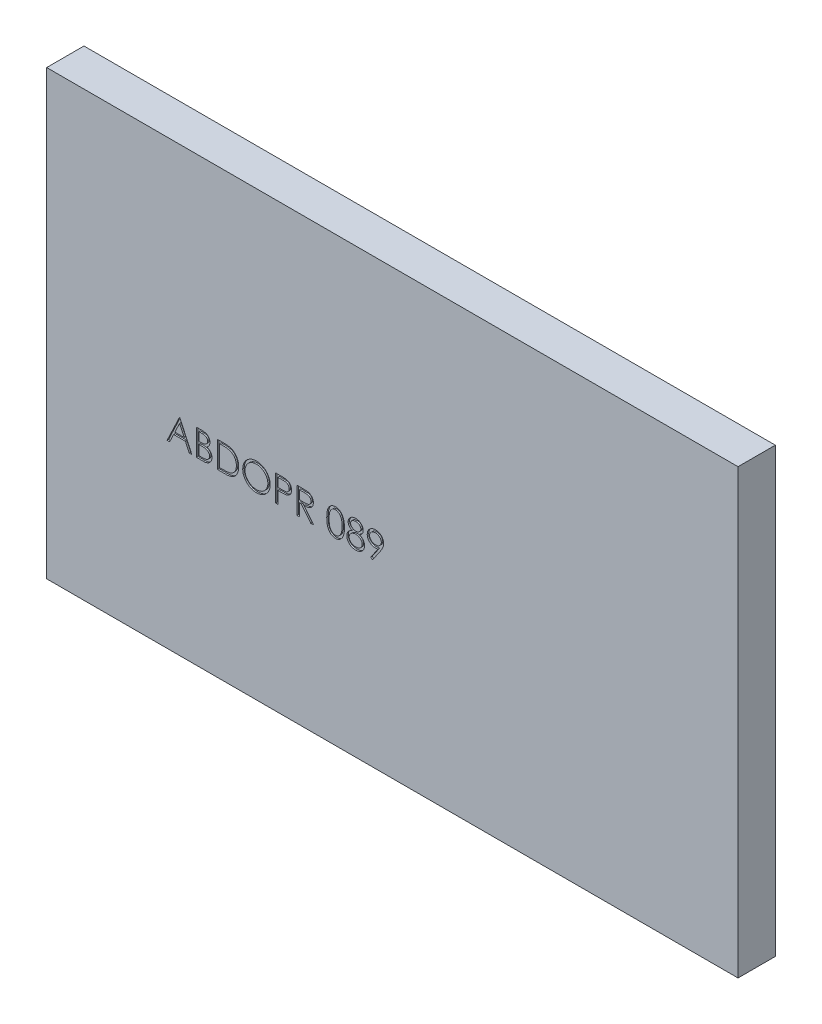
from build123d import *

# Parameters (mm, degrees)
SKIZZE1_W                       = 92.693693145
SKIZZE1_H                       = 59.371325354
LINEAR_AUSTRAGEN1_DEPTH         = 5
SCHNITT_LINEAR_AUSTRAGEN1_DEPTH = 0.2


with BuildPart() as part:
    # Skizze1 → Linear austragen1 (new body)
    with BuildSketch(Plane.XY):
        with Locations((46.346846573, 29.685662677)):
            Rectangle(SKIZZE1_W, SKIZZE1_H)
    extrude(amount=-LINEAR_AUSTRAGEN1_DEPTH)

    # Skizze2 → Schnitt-Linear austragen1 (cut)
    # profile 1 of 9: a face of its own
    with BuildSketch(Plane.XY):
        Polygon((17.849815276, 27.652351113), (19.465199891, 24.152351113), (19.123753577, 24.152351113), (18.606325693, 25.274145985), (17.019687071, 25.274145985), (16.487535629, 24.152351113), (16.144687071, 24.152351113), (17.804943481, 27.652351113), align=None)
        Polygon((17.82387377, 26.970159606), (17.190059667, 25.633120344), (18.440860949, 25.633120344), align=None, mode=Mode.SUBTRACT)
    # profile 2 of 9: a face of its own
    with BuildSketch(Plane.XY):
        with BuildLine():
            Line((20.09340502, 27.652351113), (20.776297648, 27.652351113))
            add(Edge.make_bspline(
                [(20.776297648, 27.652351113), (20.809726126, 27.652175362), (20.874518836, 27.651834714), (20.968738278, 27.646551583), (21.056987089, 27.639347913), (21.139290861, 27.627917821), (21.215611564, 27.614126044), (21.286179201, 27.597424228), (21.350769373, 27.577397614), (21.427882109, 27.545551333), (21.51580277, 27.498228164), (21.611001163, 27.428299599), (21.692405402, 27.342767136), (21.76259172, 27.246284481), (21.818392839, 27.140148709), (21.858762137, 27.02688952), (21.884320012, 26.907967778), (21.886948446, 26.8263246), (21.888276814, 26.785063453)],
                knots=[0, 0, 0, 0, 1.001505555, 1.941167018, 2.826882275, 3.653841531, 4.429895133, 5.150066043, 5.825578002, 6.45369114, 7.647487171, 8.808567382, 9.977351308, 11.170798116, 12.373658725, 13.556498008, 14.765093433, 16, 16, 16, 16], degree=3))
            add(Edge.make_bspline(
                [(21.888276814, 26.785063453), (21.887183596, 26.746410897), (21.885035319, 26.67045498), (21.864492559, 26.559360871), (21.832331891, 26.453609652), (21.787626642, 26.353587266), (21.729524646, 26.261553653), (21.660666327, 26.176766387), (21.577589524, 26.10281533), (21.515346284, 26.061472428), (21.483729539, 26.040472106)],
                knots=[0, 0, 0, 0, 1.044552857, 2.05264487, 3.044412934, 4.028983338, 5.005914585, 5.980388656, 6.974128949, 8, 8, 8, 8], degree=3))
            add(Edge.make_bspline(
                [(21.483729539, 26.040472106), (21.523489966, 26.025207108), (21.599561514, 25.996001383), (21.704247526, 25.944365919), (21.794442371, 25.888203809), (21.870839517, 25.826871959), (21.936177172, 25.760763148), (21.993230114, 25.688908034), (22.041911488, 25.610369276), (22.083624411, 25.52596574), (22.116173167, 25.436559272), (22.140549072, 25.342988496), (22.154516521, 25.245588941), (22.156504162, 25.179303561), (22.157507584, 25.145840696)],
                knots=[0, 0, 0, 0, 1.27268992, 2.434971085, 3.483601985, 4.442670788, 5.356604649, 6.2567628, 7.179492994, 8.113709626, 9.066344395, 10.018646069, 10.999752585, 12, 12, 12, 12], degree=3))
            add(Edge.make_bspline(
                [(22.157507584, 25.145840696), (22.156530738, 25.111673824), (22.154608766, 25.044449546), (22.140428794, 24.945694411), (22.116419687, 24.851319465), (22.083348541, 24.760714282), (22.040186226, 24.674054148), (21.987658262, 24.591240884), (21.925026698, 24.513106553), (21.854963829, 24.43878293), (21.775701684, 24.371955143), (21.690185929, 24.312439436), (21.597339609, 24.263493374), (21.498687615, 24.222377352), (21.393123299, 24.190970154), (21.281120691, 24.16899758), (21.162776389, 24.154192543), (21.081566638, 24.152975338), (21.039919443, 24.152351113)],
                knots=[0, 0, 0, 0, 0.978564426, 1.925352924, 2.850884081, 3.763762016, 4.682927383, 5.618979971, 6.567305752, 7.547517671, 8.540179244, 9.531824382, 10.526200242, 11.540722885, 12.589160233, 13.674978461, 14.80764778, 16, 16, 16, 16], degree=3))
            Line((21.039919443, 24.152351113), (20.09340502, 24.152351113))
            Line((20.09340502, 24.152351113), (20.09340502, 27.652351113))
        make_face()
        with BuildLine():
            Line((20.407507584, 27.293376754), (20.407507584, 26.171581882))
            Line((20.407507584, 26.171581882), (20.618545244, 26.171581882))
            add(Edge.make_bspline(
                [(20.618545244, 26.171581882), (20.649394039, 26.171981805), (20.709000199, 26.172754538), (20.795320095, 26.174968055), (20.875445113, 26.181166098), (20.949236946, 26.18736236), (21.01657939, 26.197436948), (21.077323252, 26.209429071), (21.132421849, 26.222111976), (21.195961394, 26.243681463), (21.268034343, 26.275559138), (21.344867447, 26.325030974), (21.412601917, 26.383955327), (21.469799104, 26.451946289), (21.516610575, 26.526812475), (21.54912429, 26.607359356), (21.571171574, 26.691579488), (21.573163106, 26.74939774), (21.57417425, 26.778753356)],
                knots=[0, 0, 0, 0, 1.156816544, 2.235205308, 3.236616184, 4.169592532, 5.011045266, 5.787822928, 6.49130361, 7.128639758, 8.301311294, 9.436451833, 10.541879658, 11.654887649, 12.756523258, 13.837046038, 14.901820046, 16, 16, 16, 16], degree=3))
            add(Edge.make_bspline(
                [(21.57417425, 26.778753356), (21.57364807, 26.798179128), (21.57261591, 26.8362849), (21.564162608, 26.891834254), (21.549795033, 26.944078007), (21.53134074, 26.993732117), (21.505552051, 27.039243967), (21.475188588, 27.082187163), (21.438502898, 27.121099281), (21.396745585, 27.15746878), (21.348736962, 27.189713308), (21.29450567, 27.217954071), (21.233317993, 27.240694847), (21.166205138, 27.260611), (21.092134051, 27.274599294), (21.011959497, 27.286252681), (20.925024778, 27.292185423), (20.864879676, 27.292970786), (20.833789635, 27.293376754)],
                knots=[0, 0, 0, 0, 0.91205012, 1.789085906, 2.630437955, 3.453916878, 4.269457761, 5.079663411, 5.91843418, 6.774407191, 7.675494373, 8.627863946, 9.638891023, 10.736472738, 11.911756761, 13.175263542, 14.539845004, 16, 16, 16, 16], degree=3))
            Line((20.833789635, 27.293376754), (20.407507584, 27.293376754))
        make_face(mode=Mode.SUBTRACT)
        with BuildLine():
            Line((20.407507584, 25.812607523), (20.407507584, 24.511325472))
            Line((20.407507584, 24.511325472), (20.854823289, 24.511325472))
            add(Edge.make_bspline(
                [(20.854823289, 24.511325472), (20.886842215, 24.511709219), (20.948554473, 24.512448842), (21.037655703, 24.514863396), (21.120238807, 24.520355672), (21.195926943, 24.529001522), (21.265537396, 24.538379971), (21.328235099, 24.550991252), (21.384528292, 24.565440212), (21.4498026, 24.587774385), (21.523306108, 24.622470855), (21.602516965, 24.674785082), (21.672943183, 24.73710839), (21.732748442, 24.809239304), (21.78176143, 24.887670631), (21.817416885, 24.970815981), (21.839407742, 25.057301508), (21.842069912, 25.116268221), (21.84340502, 25.145840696)],
                knots=[0, 0, 0, 0, 1.160039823, 2.235823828, 3.228722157, 4.157150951, 4.99529583, 5.772374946, 6.472645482, 7.099169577, 8.269452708, 9.405989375, 10.527446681, 11.663510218, 12.788923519, 13.866172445, 14.929861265, 16, 16, 16, 16], degree=3))
            add(Edge.make_bspline(
                [(21.84340502, 25.145840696), (21.843128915, 25.164334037), (21.84258116, 25.201022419), (21.834320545, 25.254938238), (21.822306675, 25.307164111), (21.806775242, 25.357841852), (21.784155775, 25.406055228), (21.757749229, 25.452757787), (21.726787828, 25.498011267), (21.678543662, 25.55522352), (21.608371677, 25.621140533), (21.508664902, 25.685678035), (21.395292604, 25.737725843), (21.313065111, 25.759825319), (21.270588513, 25.771241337)],
                knots=[0, 0, 0, 0, 0.723448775, 1.435228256, 2.130040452, 2.821711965, 3.505591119, 4.210454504, 4.921174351, 5.648778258, 7.137944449, 8.670945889, 10.280296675, 12, 12, 12, 12], degree=3))
            add(Edge.make_bspline(
                [(21.270588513, 25.771241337), (21.253559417, 25.774696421), (21.216636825, 25.782187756), (21.156429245, 25.790095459), (21.087693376, 25.797140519), (21.010270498, 25.802351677), (20.924062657, 25.80773822), (20.828885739, 25.809833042), (20.725128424, 25.812332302), (20.653136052, 25.812513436), (20.615740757, 25.812607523)],
                knots=[0, 0, 0, 0, 0.634451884, 1.375622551, 2.216452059, 3.157844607, 4.20941857, 5.370758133, 6.634282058, 8, 8, 8, 8], degree=3))
            Line((20.615740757, 25.812607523), (20.407507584, 25.812607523))
        make_face(mode=Mode.SUBTRACT)
    # profile 3 of 9: a face of its own
    with BuildSketch(Plane.XY):
        with BuildLine():
            Line((22.875456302, 24.152351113), (22.875456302, 27.652351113))
            Line((22.875456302, 27.652351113), (23.582187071, 27.652351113))
            add(Edge.make_bspline(
                [(23.582187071, 27.652351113), (23.643656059, 27.651908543), (23.762413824, 27.6510535), (23.934026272, 27.645632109), (24.092810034, 27.636041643), (24.238242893, 27.622072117), (24.370724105, 27.604919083), (24.489882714, 27.583418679), (24.596334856, 27.558030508), (24.661804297, 27.536385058), (24.692763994, 27.52614919)],
                knots=[0, 0, 0, 0, 1.314313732, 2.53924729, 3.670748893, 4.714932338, 5.66265055, 6.526160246, 7.303039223, 8, 8, 8, 8], degree=3))
            add(Edge.make_bspline(
                [(24.692763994, 27.52614919), (24.733258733, 27.510718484), (24.813329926, 27.48020699), (24.927337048, 27.422650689), (25.034662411, 27.357437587), (25.135881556, 27.284481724), (25.228682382, 27.201717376), (25.316690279, 27.11266029), (25.396305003, 27.01407195), (25.469213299, 26.907996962), (25.534948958, 26.79568491), (25.592088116, 26.677349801), (25.63954211, 26.553592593), (25.678935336, 26.424757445), (25.709981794, 26.290561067), (25.731163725, 26.150847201), (25.745134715, 26.006168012), (25.746538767, 25.907993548), (25.747251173, 25.85818044)],
                knots=[0, 0, 0, 0, 0.984719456, 1.947108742, 2.898477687, 3.838006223, 4.779231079, 5.722358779, 6.681677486, 7.655904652, 8.64651281, 9.637519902, 10.640069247, 11.656948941, 12.698408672, 13.768548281, 14.867775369, 16, 16, 16, 16], degree=3))
            add(Edge.make_bspline(
                [(25.747251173, 25.85818044), (25.746622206, 25.814919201), (25.74538276, 25.729668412), (25.734253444, 25.604027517), (25.718077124, 25.482113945), (25.693032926, 25.364508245), (25.662630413, 25.250180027), (25.623666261, 25.140347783), (25.579030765, 25.034003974), (25.526980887, 24.932586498), (25.469839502, 24.836503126), (25.408517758, 24.745927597), (25.343081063, 24.662152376), (25.27290543, 24.584923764), (25.198897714, 24.514358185), (25.120573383, 24.44986617), (25.037730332, 24.392709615), (24.95073961, 24.340642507), (24.85706348, 24.295222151), (24.754927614, 24.256792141), (24.643896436, 24.224945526), (24.524242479, 24.19837463), (24.395759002, 24.177297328), (24.258320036, 24.163170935), (24.112136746, 24.153618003), (24.011757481, 24.152781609), (23.960091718, 24.152351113)],
                knots=[0, 0, 0, 0, 1.105936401, 2.179363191, 3.223086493, 4.248585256, 5.251745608, 6.245858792, 7.225916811, 8.198733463, 9.158002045, 10.082870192, 10.993790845, 11.873723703, 12.748670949, 13.606408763, 14.465103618, 15.319838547, 16.196477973, 17.123216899, 18.106603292, 19.147568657, 20.255746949, 21.433717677, 22.679120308, 24, 24, 24, 24], degree=3))
            Line((23.960091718, 24.152351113), (22.875456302, 24.152351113))
        make_face()
        with BuildLine():
            Line((23.189558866, 24.511325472), (23.591301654, 24.511325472))
            add(Edge.make_bspline(
                [(23.591301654, 24.511325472), (23.649030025, 24.511573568), (23.760062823, 24.512050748), (23.919720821, 24.516237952), (24.065600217, 24.523079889), (24.197721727, 24.532654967), (24.316010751, 24.545323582), (24.420714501, 24.559448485), (24.511489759, 24.577045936), (24.566419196, 24.592996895), (24.591802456, 24.60036794)],
                knots=[0, 0, 0, 0, 1.375205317, 2.645023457, 3.804390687, 4.853969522, 5.800190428, 6.637939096, 7.370582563, 8, 8, 8, 8], degree=3))
            add(Edge.make_bspline(
                [(24.591802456, 24.60036794), (24.623750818, 24.611619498), (24.686884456, 24.633853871), (24.777765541, 24.674411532), (24.862522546, 24.722453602), (24.942632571, 24.775855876), (25.016959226, 24.836501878), (25.086383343, 24.903072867), (25.150765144, 24.975907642), (25.209439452, 25.054915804), (25.261947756, 25.139605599), (25.307418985, 25.229144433), (25.347270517, 25.322551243), (25.37854911, 25.421260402), (25.403064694, 25.52438946), (25.420429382, 25.631945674), (25.431244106, 25.743908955), (25.432505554, 25.82006108), (25.433148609, 25.858881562)],
                knots=[0, 0, 0, 0, 0.998632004, 1.973411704, 2.929992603, 3.868527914, 4.809262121, 5.754881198, 6.702106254, 7.672490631, 8.653608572, 9.636854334, 10.631411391, 11.644891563, 12.686317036, 13.754757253, 14.855430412, 16, 16, 16, 16], degree=3))
            add(Edge.make_bspline(
                [(25.433148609, 25.858881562), (25.432635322, 25.899815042), (25.431626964, 25.980229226), (25.418952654, 26.098219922), (25.400431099, 26.211700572), (25.373647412, 26.320678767), (25.339516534, 26.42536712), (25.296921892, 26.52518663), (25.248255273, 26.621191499), (25.190351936, 26.711165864), (25.126936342, 26.796258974), (25.056558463, 26.874213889), (24.980336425, 26.945208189), (24.899101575, 27.010347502), (24.810564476, 27.067011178), (24.716810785, 27.117697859), (24.616465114, 27.16071375), (24.546652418, 27.183592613), (24.511173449, 27.195219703)],
                knots=[0, 0, 0, 0, 1.122418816, 2.205001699, 3.251619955, 4.274784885, 5.280384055, 6.268708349, 7.249350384, 8.229342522, 9.199999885, 10.157847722, 11.105861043, 12.055065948, 13.010012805, 13.98527497, 14.976112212, 16, 16, 16, 16], degree=3))
            add(Edge.make_bspline(
                [(24.511173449, 27.195219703), (24.481822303, 27.203336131), (24.419413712, 27.220593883), (24.317574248, 27.239419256), (24.202959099, 27.256023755), (24.075059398, 27.270081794), (23.934020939, 27.280169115), (23.779735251, 27.28774043), (23.612135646, 27.292847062), (23.495953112, 27.29319577), (23.435652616, 27.293376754)],
                knots=[0, 0, 0, 0, 0.674548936, 1.434276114, 2.292660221, 3.240891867, 4.284742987, 5.42552168, 6.663806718, 8, 8, 8, 8], degree=3))
            Line((23.435652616, 27.293376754), (23.189558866, 27.293376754))
            Line((23.189558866, 27.293376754), (23.189558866, 24.511325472))
        make_face(mode=Mode.SUBTRACT)
    # profile 4 of 9: a face of its own
    with BuildSketch(Plane.XY):
        with BuildLine():
            add(Edge.make_bspline(
                [(28.103020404, 27.742094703), (28.16782851, 27.740453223), (28.295116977, 27.737229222), (28.482191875, 27.712550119), (28.66078697, 27.669854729), (28.832357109, 27.612991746), (28.994850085, 27.537137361), (29.149488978, 27.445452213), (29.295905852, 27.336975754), (29.432127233, 27.212546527), (29.556784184, 27.077163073), (29.66661007, 26.932685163), (29.758652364, 26.779986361), (29.834238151, 26.61952553), (29.89353676, 26.451665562), (29.934455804, 26.275511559), (29.960593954, 26.092204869), (29.963649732, 25.967178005), (29.965199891, 25.903753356)],
                knots=[0, 0, 0, 0, 1.065120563, 2.091984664, 3.0946048, 4.079830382, 5.057816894, 6.036188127, 7.030412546, 8.04752943, 9.064399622, 10.05169764, 11.02544977, 11.989514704, 12.962713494, 13.945757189, 14.957906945, 16, 16, 16, 16], degree=3))
            add(Edge.make_bspline(
                [(29.965199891, 25.903753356), (29.963649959, 25.84079591), (29.960594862, 25.71669949), (29.934426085, 25.534556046), (29.893385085, 25.359465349), (29.834788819, 25.191719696), (29.75956334, 25.031142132), (29.666908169, 24.878155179), (29.557766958, 24.73270868), (29.433560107, 24.596396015), (29.298159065, 24.471398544), (29.152928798, 24.362479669), (29.001135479, 24.268755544), (28.84082577, 24.19397187), (28.674125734, 24.13419995), (28.49954341, 24.09344732), (28.317896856, 24.067160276), (28.194025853, 24.06414176), (28.131065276, 24.062607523)],
                knots=[0, 0, 0, 0, 1.043624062, 2.057103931, 3.04512605, 4.022047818, 4.998200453, 5.980619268, 6.982898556, 8.009068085, 9.034988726, 10.034168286, 11.015286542, 11.987931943, 12.962482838, 13.94673481, 14.956375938, 16, 16, 16, 16], degree=3))
            add(Edge.make_bspline(
                [(28.131065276, 24.062607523), (28.067640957, 24.06415691), (27.942614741, 24.067211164), (27.759077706, 24.093392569), (27.582799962, 24.134333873), (27.414285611, 24.192843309), (27.253440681, 24.268460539), (27.099950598, 24.360664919), (26.954431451, 24.47007206), (26.818089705, 24.594238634), (26.693340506, 24.729410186), (26.584581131, 24.874244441), (26.492356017, 25.025899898), (26.416992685, 25.184797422), (26.357328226, 25.350168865), (26.316623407, 25.523117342), (26.290287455, 25.702656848), (26.287252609, 25.824899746), (26.285712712, 25.886926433)],
                knots=[0, 0, 0, 0, 1.053102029, 2.075944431, 3.073151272, 4.055350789, 5.033113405, 6.020478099, 7.024410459, 8.052272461, 9.079885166, 10.07527673, 11.055994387, 12.023226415, 12.992069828, 13.970394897, 14.97016774, 16, 16, 16, 16], degree=3))
            add(Edge.make_bspline(
                [(26.285712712, 25.886926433), (26.286247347, 25.928559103), (26.287309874, 26.011299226), (26.300101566, 26.134165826), (26.318663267, 26.255056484), (26.34526518, 26.373627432), (26.380056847, 26.489588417), (26.421108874, 26.603739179), (26.47124872, 26.714922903), (26.527929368, 26.823666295), (26.591191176, 26.928274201), (26.661066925, 27.027153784), (26.735102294, 27.121134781), (26.816265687, 27.207781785), (26.901882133, 27.289615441), (26.993340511, 27.365378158), (27.090082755, 27.435753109), (27.192525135, 27.49917345), (27.29814341, 27.556532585), (27.407020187, 27.605754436), (27.517676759, 27.648000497), (27.630631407, 27.682241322), (27.745584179, 27.709273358), (27.862785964, 27.727680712), (27.98214339, 27.74050503), (28.062554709, 27.741562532), (28.103020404, 27.742094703)],
                knots=[0, 0, 0, 0, 1.037015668, 2.060948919, 3.074880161, 4.083647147, 5.086022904, 6.090072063, 7.104153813, 8.122640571, 9.144368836, 10.147691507, 11.138137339, 12.123020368, 13.103399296, 14.087645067, 15.080126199, 16.082011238, 17.087798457, 18.072939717, 19.057185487, 20.037253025, 21.01195951, 21.997135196, 22.992090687, 24, 24, 24, 24], degree=3))
        make_face()
        with BuildLine():
            add(Edge.make_bspline(
                [(28.118445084, 27.383120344), (28.08523045, 27.382715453), (28.019118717, 27.381909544), (27.920834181, 27.371293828), (27.823842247, 27.356163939), (27.728122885, 27.334582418), (27.634076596, 27.305178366), (27.540826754, 27.271337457), (27.449223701, 27.230116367), (27.359569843, 27.183543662), (27.272654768, 27.131994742), (27.190642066, 27.075022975), (27.113319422, 27.01396442), (27.040876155, 26.948676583), (26.973524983, 26.878826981), (26.909940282, 26.805474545), (26.8526707, 26.726522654), (26.800185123, 26.644112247), (26.753217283, 26.558350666), (26.711451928, 26.470140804), (26.67728792, 26.378763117), (26.649425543, 26.285208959), (26.626325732, 26.1896265), (26.611691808, 26.091290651), (26.600959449, 25.990695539), (26.600199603, 25.922713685), (26.599815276, 25.888328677)],
                knots=[0, 0, 0, 0, 1.008559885, 2.007477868, 2.99961109, 3.989939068, 4.984837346, 5.991145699, 7.001802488, 8.033829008, 9.059044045, 10.069351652, 11.065060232, 12.050310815, 13.029377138, 14.011219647, 14.996725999, 15.989392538, 16.977580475, 17.965360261, 18.951710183, 19.937753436, 20.929683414, 21.935841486, 22.955955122, 24, 24, 24, 24], degree=3))
            add(Edge.make_bspline(
                [(26.599815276, 25.888328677), (26.601090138, 25.837766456), (26.603598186, 25.738294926), (26.625555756, 25.592526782), (26.65937773, 25.452438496), (26.709235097, 25.318796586), (26.771585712, 25.190452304), (26.848612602, 25.068544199), (26.939871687, 24.953039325), (27.043535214, 24.844744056), (27.156857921, 24.745898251), (27.27719065, 24.659134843), (27.403244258, 24.585724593), (27.535347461, 24.52591952), (27.672795, 24.478529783), (27.816472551, 24.446051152), (27.96542301, 24.424675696), (28.066953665, 24.42262294), (28.118445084, 24.421581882)],
                knots=[0, 0, 0, 0, 1.032063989, 2.030389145, 3.003944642, 3.970395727, 4.937377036, 5.913328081, 6.909231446, 7.93887556, 8.970685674, 9.976071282, 10.964166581, 11.944589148, 12.933237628, 13.927779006, 14.949070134, 16, 16, 16, 16], degree=3))
            add(Edge.make_bspline(
                [(28.118445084, 24.421581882), (28.153054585, 24.422057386), (28.221695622, 24.423000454), (28.323791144, 24.432499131), (28.424047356, 24.447731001), (28.522323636, 24.469661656), (28.618508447, 24.497108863), (28.71300325, 24.529716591), (28.80480154, 24.570397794), (28.895061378, 24.615345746), (28.98145762, 24.666585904), (29.063933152, 24.721624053), (29.140409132, 24.782592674), (29.212798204, 24.846910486), (29.280425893, 24.915874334), (29.342834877, 24.989394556), (29.399815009, 25.067935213), (29.452280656, 25.150220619), (29.499083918, 25.236216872), (29.539863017, 25.32474655), (29.574459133, 25.415591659), (29.602387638, 25.508883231), (29.6242731, 25.604444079), (29.63935302, 25.702402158), (29.649901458, 25.8025615), (29.650696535, 25.870305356), (29.651097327, 25.904454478)],
                knots=[0, 0, 0, 0, 1.047197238, 2.076906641, 3.100256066, 4.114471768, 5.12198147, 6.126382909, 7.136867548, 8.15857795, 9.17633901, 10.174870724, 11.156907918, 12.133735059, 13.104061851, 14.077631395, 15.04955518, 16.038496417, 17.029181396, 18.010275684, 18.986308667, 19.968651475, 20.955262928, 21.950658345, 22.966943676, 24, 24, 24, 24], degree=3))
            add(Edge.make_bspline(
                [(29.651097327, 25.904454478), (29.650696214, 25.938369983), (29.649900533, 26.005647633), (29.639358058, 26.105108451), (29.624257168, 26.202361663), (29.60249446, 26.297025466), (29.574444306, 26.389123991), (29.539856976, 26.478570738), (29.499071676, 26.565698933), (29.452263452, 26.65029323), (29.399647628, 26.731467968), (29.342153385, 26.809070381), (29.278788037, 26.881643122), (29.211362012, 26.950977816), (29.138191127, 27.015595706), (29.059606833, 27.075518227), (28.976563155, 27.132191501), (28.888635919, 27.183317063), (28.797891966, 27.230531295), (28.704778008, 27.270982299), (28.610348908, 27.305354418), (28.514844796, 27.334671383), (28.417461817, 27.356079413), (28.318857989, 27.371307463), (28.21916973, 27.381905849), (28.15212651, 27.382714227), (28.118445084, 27.383120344)],
                knots=[0, 0, 0, 0, 1.02996197, 2.043119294, 3.035359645, 4.018872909, 4.991431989, 5.957985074, 6.929999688, 7.912076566, 8.892894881, 9.867085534, 10.843653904, 11.817741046, 12.803660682, 13.806313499, 14.818574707, 15.856120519, 16.894564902, 17.924820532, 18.937903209, 19.946497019, 20.957711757, 21.963978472, 22.977135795, 24, 24, 24, 24], degree=3))
        make_face(mode=Mode.SUBTRACT)
    # profile 5 of 9: a face of its own
    with BuildSketch(Plane.XY):
        with BuildLine():
            Line((30.683148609, 27.652351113), (31.369546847, 27.652351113))
            add(Edge.make_bspline(
                [(31.369546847, 27.652351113), (31.416757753, 27.652299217), (31.507215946, 27.652199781), (31.636931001, 27.649185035), (31.754740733, 27.645158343), (31.860391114, 27.63957645), (31.954207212, 27.63297986), (32.035764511, 27.62372782), (32.105704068, 27.614067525), (32.147610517, 27.604246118), (32.166722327, 27.599766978)],
                knots=[0, 0, 0, 0, 1.415646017, 2.712440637, 3.8905458, 4.950247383, 5.884950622, 6.709939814, 7.411656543, 8, 8, 8, 8], degree=3))
            add(Edge.make_bspline(
                [(32.166722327, 27.599766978), (32.190915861, 27.593145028), (32.238732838, 27.580057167), (32.307633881, 27.553843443), (32.373187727, 27.522761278), (32.435619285, 27.487337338), (32.494161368, 27.446051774), (32.549687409, 27.400578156), (32.60170739, 27.349866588), (32.649928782, 27.294485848), (32.694213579, 27.235365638), (32.732343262, 27.171623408), (32.764270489, 27.104332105), (32.79165376, 27.033538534), (32.811362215, 26.95864821), (32.826209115, 26.880181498), (32.835632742, 26.798146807), (32.836535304, 26.74208694), (32.836994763, 26.71354903)],
                knots=[0, 0, 0, 0, 0.999701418, 1.975846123, 2.934577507, 3.890451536, 4.834027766, 5.787354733, 6.749476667, 7.726910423, 8.712836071, 9.690891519, 10.682875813, 11.679750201, 12.712814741, 13.765529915, 14.8625177, 16, 16, 16, 16], degree=3))
            add(Edge.make_bspline(
                [(32.836994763, 26.71354903), (32.836573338, 26.684771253), (32.835748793, 26.628465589), (32.825852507, 26.546092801), (32.812522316, 26.467374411), (32.792025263, 26.39248496), (32.76517959, 26.32186919), (32.733687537, 26.254447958), (32.695704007, 26.191368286), (32.652059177, 26.132401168), (32.603507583, 26.077491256), (32.550254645, 26.027036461), (32.492515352, 25.981332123), (32.430473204, 25.940275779), (32.363523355, 25.9048195), (32.292681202, 25.873062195), (32.217330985, 25.846391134), (32.165188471, 25.832361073), (32.138677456, 25.825227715)],
                knots=[0, 0, 0, 0, 1.121902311, 2.195077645, 3.232258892, 4.234102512, 5.217864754, 6.176164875, 7.132989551, 8.084763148, 9.034132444, 9.988522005, 10.94243251, 11.903244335, 12.886203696, 13.894208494, 14.929344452, 16, 16, 16, 16], degree=3))
            add(Edge.make_bspline(
                [(32.138677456, 25.825227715), (32.116750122, 25.820564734), (32.068695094, 25.81034554), (31.989552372, 25.798937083), (31.897406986, 25.789199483), (31.792384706, 25.781898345), (31.674579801, 25.775647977), (31.543928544, 25.770679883), (31.400174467, 25.767950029), (31.299903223, 25.767809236), (31.247551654, 25.767735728)],
                knots=[0, 0, 0, 0, 0.601384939, 1.31797006, 2.144135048, 3.087295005, 4.142315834, 5.309527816, 6.595305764, 8, 8, 8, 8], degree=3))
            Line((31.247551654, 25.767735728), (30.997251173, 25.767735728))
            Line((30.997251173, 25.767735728), (30.997251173, 24.152351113))
            Line((30.997251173, 24.152351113), (30.683148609, 24.152351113))
            Line((30.683148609, 24.152351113), (30.683148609, 27.652351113))
        make_face()
        with BuildLine():
            Line((30.997251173, 27.293376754), (30.997251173, 26.126710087))
            Line((30.997251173, 26.126710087), (31.610031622, 26.118997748))
            add(Edge.make_bspline(
                [(31.610031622, 26.118997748), (31.639951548, 26.118982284), (31.697711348, 26.118952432), (31.781147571, 26.122937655), (31.858556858, 26.127538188), (31.929701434, 26.134274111), (31.994613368, 26.143795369), (32.053400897, 26.153407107), (32.10560818, 26.167312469), (32.166707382, 26.186035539), (32.234790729, 26.217968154), (32.308858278, 26.264318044), (32.371628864, 26.323398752), (32.425947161, 26.389826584), (32.469053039, 26.463725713), (32.500609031, 26.54279465), (32.519150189, 26.626222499), (32.521636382, 26.683310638), (32.522892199, 26.712146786)],
                knots=[0, 0, 0, 0, 1.160613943, 2.240541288, 3.23993089, 4.169200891, 5.011653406, 5.7853311, 6.478053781, 7.106038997, 8.262395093, 9.384106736, 10.481365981, 11.59014053, 12.70357646, 13.786202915, 14.881775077, 16, 16, 16, 16], degree=3))
            add(Edge.make_bspline(
                [(32.522892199, 26.712146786), (32.521629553, 26.740285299), (32.519119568, 26.796221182), (32.500463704, 26.878199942), (32.469114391, 26.956435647), (32.425657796, 27.029408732), (32.372916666, 27.095597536), (32.311617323, 27.153094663), (32.241904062, 27.199316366), (32.177055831, 27.229149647), (32.119454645, 27.247364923), (32.069422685, 27.260109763), (32.01293201, 27.270285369), (31.949964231, 27.278524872), (31.881007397, 27.285578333), (31.805469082, 27.290364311), (31.723635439, 27.293165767), (31.666824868, 27.293304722), (31.637375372, 27.293376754)],
                knots=[0, 0, 0, 0, 1.120700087, 2.227813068, 3.331159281, 4.466773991, 5.599788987, 6.693661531, 7.80175334, 8.91857717, 9.525282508, 10.207424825, 10.974604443, 11.810962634, 12.737642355, 13.736264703, 14.826523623, 16, 16, 16, 16], degree=3))
            Line((31.637375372, 27.293376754), (30.997251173, 27.293376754))
        make_face(mode=Mode.SUBTRACT)
    # profile 6 of 9: a face of its own
    with BuildSketch(Plane.XY):
        with BuildLine():
            Line((33.554943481, 27.652351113), (34.255364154, 27.652351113))
            add(Edge.make_bspline(
                [(34.255364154, 27.652351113), (34.302105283, 27.652195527), (34.391853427, 27.651896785), (34.520426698, 27.650231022), (34.637253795, 27.645456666), (34.742273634, 27.641348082), (34.835484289, 27.633856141), (34.91717158, 27.626695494), (34.986959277, 27.617321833), (35.029205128, 27.60861641), (35.048332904, 27.604674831)],
                knots=[0, 0, 0, 0, 1.410062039, 2.707475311, 3.878576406, 4.937260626, 5.877586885, 6.699081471, 7.410979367, 8, 8, 8, 8], degree=3))
            add(Edge.make_bspline(
                [(35.048332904, 27.604674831), (35.073939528, 27.598348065), (35.124606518, 27.585829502), (35.197556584, 27.559369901), (35.267070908, 27.528750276), (35.332860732, 27.492786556), (35.394596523, 27.451211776), (35.452914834, 27.404743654), (35.508080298, 27.353636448), (35.557861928, 27.296601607), (35.604800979, 27.236765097), (35.644389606, 27.17206134), (35.678516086, 27.104399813), (35.705686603, 27.033092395), (35.727564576, 26.958830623), (35.742990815, 26.880941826), (35.752242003, 26.799780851), (35.753183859, 26.744422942), (35.75366143, 26.716353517)],
                knots=[0, 0, 0, 0, 1.027469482, 2.033020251, 3.019912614, 3.986113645, 4.951240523, 5.91722682, 6.890402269, 7.87763091, 8.8651537, 9.85103654, 10.82876324, 11.815024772, 12.821070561, 13.842952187, 14.906261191, 16, 16, 16, 16], degree=3))
            add(Edge.make_bspline(
                [(35.75366143, 26.716353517), (35.752192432, 26.669718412), (35.749326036, 26.578721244), (35.722600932, 26.446660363), (35.678824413, 26.323471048), (35.618501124, 26.20930841), (35.541681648, 26.106397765), (35.449356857, 26.01600731), (35.341475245, 25.940367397), (35.241045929, 25.887914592), (35.15233173, 25.854321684), (35.079298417, 25.830685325), (34.999631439, 25.81242336), (34.914094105, 25.796063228), (34.822330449, 25.783711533), (34.72456041, 25.774664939), (34.620714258, 25.76901089), (34.549375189, 25.768168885), (34.512675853, 25.767735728)],
                knots=[0, 0, 0, 0, 1.260483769, 2.459530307, 3.627416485, 4.787058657, 5.939039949, 7.08810263, 8.267026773, 9.491475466, 10.141966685, 10.831826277, 11.566392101, 12.351337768, 13.187381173, 14.07005841, 15.007169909, 16, 16, 16, 16], degree=3))
            Line((34.512675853, 25.767735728), (35.798533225, 24.152351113))
            Line((35.798533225, 24.152351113), (35.41011175, 24.152351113))
            Line((35.41011175, 24.152351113), (34.124254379, 25.767735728))
            Line((34.124254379, 25.767735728), (33.869046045, 25.767735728))
            Line((33.869046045, 25.767735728), (33.869046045, 24.152351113))
            Line((33.869046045, 24.152351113), (33.554943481, 24.152351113))
            Line((33.554943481, 24.152351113), (33.554943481, 27.652351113))
        make_face()
        with BuildLine():
            Line((33.869046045, 27.293376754), (33.869046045, 26.126710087))
            Line((33.869046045, 26.126710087), (34.509871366, 26.121802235))
            add(Edge.make_bspline(
                [(34.509871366, 26.121802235), (34.539791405, 26.121788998), (34.597784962, 26.121763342), (34.681685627, 26.125757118), (34.759805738, 26.130300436), (34.83184649, 26.137249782), (34.897840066, 26.146205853), (34.957753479, 26.157408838), (35.011684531, 26.1704609), (35.074583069, 26.190662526), (35.144819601, 26.222668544), (35.221151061, 26.269234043), (35.286153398, 26.327803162), (35.341071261, 26.394776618), (35.385200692, 26.468412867), (35.416312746, 26.547829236), (35.436055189, 26.631020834), (35.438383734, 26.688198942), (35.439558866, 26.717054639)],
                knots=[0, 0, 0, 0, 1.146690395, 2.22261258, 3.21895312, 4.145990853, 4.996080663, 5.770904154, 6.481378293, 7.121626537, 8.300444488, 9.431385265, 10.535395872, 11.636531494, 12.74115979, 13.810798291, 14.895190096, 16, 16, 16, 16], degree=3))
            add(Edge.make_bspline(
                [(35.439558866, 26.717054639), (35.438356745, 26.745201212), (35.435974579, 26.800977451), (35.416525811, 26.882633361), (35.383636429, 26.959700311), (35.339314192, 27.031864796), (35.285315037, 27.097370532), (35.221997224, 27.153417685), (35.151092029, 27.19966715), (35.08482083, 27.22922153), (35.025586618, 27.247341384), (34.974156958, 27.260092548), (34.91604548, 27.270337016), (34.850970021, 27.278545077), (34.779208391, 27.285600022), (34.70039774, 27.2903518), (34.615060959, 27.293165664), (34.555914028, 27.293304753), (34.525296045, 27.293376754)],
                knots=[0, 0, 0, 0, 1.101028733, 2.181837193, 3.264309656, 4.369019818, 5.486613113, 6.575447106, 7.666700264, 8.788928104, 9.402425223, 10.0903467, 10.862060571, 11.710948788, 12.657782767, 13.684531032, 14.801375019, 16, 16, 16, 16], degree=3))
            Line((34.525296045, 27.293376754), (33.869046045, 27.293376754))
        make_face(mode=Mode.SUBTRACT)
    # profile 7 of 9: a face of its own
    with BuildSketch(Plane.XY):
        with BuildLine():
            add(Edge.make_bspline(
                [(37.548533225, 25.900948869), (37.548861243, 25.957046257), (37.549498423, 26.066016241), (37.556586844, 26.224800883), (37.568362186, 26.373761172), (37.584499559, 26.512904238), (37.604137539, 26.642266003), (37.630353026, 26.76150076), (37.660165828, 26.871160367), (37.694718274, 26.971602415), (37.733706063, 27.064180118), (37.776140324, 27.150605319), (37.823705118, 27.230747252), (37.873682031, 27.305885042), (37.928094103, 27.374788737), (37.985392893, 27.4384314), (38.04781477, 27.49534215), (38.113237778, 27.547188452), (38.182254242, 27.592637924), (38.252896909, 27.632670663), (38.325652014, 27.66687053), (38.400718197, 27.693760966), (38.477420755, 27.715971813), (38.556027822, 27.73116076), (38.636669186, 27.740717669), (38.691100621, 27.741631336), (38.7187055, 27.742094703)],
                knots=[0, 0, 0, 0, 1.646270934, 3.197905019, 4.663502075, 6.030701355, 7.308322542, 8.50163776, 9.611534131, 10.641858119, 11.616356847, 12.558055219, 13.465016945, 14.349605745, 15.204443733, 16.039544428, 16.859896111, 17.680448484, 18.487036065, 19.28249412, 20.06191084, 20.843045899, 21.620316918, 22.403196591, 23.190181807, 24, 24, 24, 24], degree=3))
            add(Edge.make_bspline(
                [(38.7187055, 27.742094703), (38.746540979, 27.741606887), (38.801896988, 27.740636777), (38.883737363, 27.731312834), (38.963687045, 27.715841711), (39.041405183, 27.693920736), (39.11753017, 27.66672506), (39.191466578, 27.632637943), (39.263673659, 27.592959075), (39.333003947, 27.546335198), (39.400218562, 27.494352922), (39.463666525, 27.435590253), (39.523353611, 27.370640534), (39.580028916, 27.30019867), (39.632084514, 27.222913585), (39.681657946, 27.140129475), (39.726029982, 27.05039861), (39.768764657, 26.955218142), (39.805651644, 26.851954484), (39.838917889, 26.741189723), (39.865796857, 26.621615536), (39.88818613, 26.493859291), (39.905531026, 26.357451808), (39.918163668, 26.212685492), (39.924836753, 26.059465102), (39.926093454, 25.954707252), (39.926738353, 25.900948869)],
                knots=[0, 0, 0, 0, 0.810914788, 1.612654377, 2.396697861, 3.181598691, 3.963628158, 4.749916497, 5.551656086, 6.361998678, 7.18212741, 8.025565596, 8.878627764, 9.750805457, 10.657531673, 11.591944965, 12.560506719, 13.57287815, 14.630710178, 15.753379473, 16.941251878, 18.199788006, 19.531962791, 20.947069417, 22.433333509, 24, 24, 24, 24], degree=3))
            add(Edge.make_bspline(
                [(39.926738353, 25.900948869), (39.926086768, 25.847424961), (39.924817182, 25.743135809), (39.918238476, 25.590604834), (39.905279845, 25.446606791), (39.889069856, 25.310796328), (39.866618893, 25.18373871), (39.839013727, 25.064994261), (39.808363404, 24.954050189), (39.77052861, 24.851815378), (39.7291179, 24.756863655), (39.684062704, 24.668196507), (39.635792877, 24.585030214), (39.583204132, 24.508030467), (39.527150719, 24.43665181), (39.46643293, 24.372154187), (39.402762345, 24.312983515), (39.33534993, 24.260331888), (39.264938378, 24.214247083), (39.192979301, 24.173033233), (39.118195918, 24.139800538), (39.042282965, 24.111265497), (38.964154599, 24.089465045), (38.883908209, 24.074391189), (38.801951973, 24.063819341), (38.746550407, 24.063012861), (38.7187055, 24.062607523)],
                knots=[0, 0, 0, 0, 1.561518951, 3.042555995, 4.452378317, 5.7783523, 7.031515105, 8.214008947, 9.334062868, 10.386615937, 11.391082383, 12.354592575, 13.286541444, 14.194233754, 15.072674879, 15.931287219, 16.775624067, 17.606195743, 18.42308326, 19.229000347, 20.022332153, 20.807536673, 21.593273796, 22.3848459, 23.188221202, 24, 24, 24, 24], degree=3))
            add(Edge.make_bspline(
                [(38.7187055, 24.062607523), (38.691101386, 24.063073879), (38.636671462, 24.063993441), (38.556019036, 24.073507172), (38.477736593, 24.088802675), (38.401437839, 24.110219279), (38.326731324, 24.136434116), (38.254635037, 24.170587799), (38.184347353, 24.209921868), (38.116055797, 24.25471729), (38.051043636, 24.306038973), (37.988945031, 24.362803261), (37.931320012, 24.426426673), (37.877685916, 24.495904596), (37.826711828, 24.570597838), (37.779822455, 24.651526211), (37.736451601, 24.738368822), (37.69680811, 24.831686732), (37.661659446, 24.93284166), (37.630611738, 25.042990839), (37.606097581, 25.163106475), (37.585114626, 25.292223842), (37.568190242, 25.430897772), (37.556635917, 25.579203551), (37.549494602, 25.737048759), (37.548859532, 25.845318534), (37.548533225, 25.900948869)],
                knots=[0, 0, 0, 0, 0.810891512, 1.598919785, 2.382837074, 3.152667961, 3.926044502, 4.706494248, 5.493654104, 6.291793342, 7.103789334, 7.925228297, 8.761435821, 9.622817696, 10.50288917, 11.416980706, 12.369136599, 13.353924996, 14.394355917, 15.514179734, 16.714354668, 17.994756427, 19.357759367, 20.818452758, 22.365282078, 24, 24, 24, 24], degree=3))
        make_face()
        with BuildLine():
            add(Edge.make_bspline(
                [(37.862635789, 25.902351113), (37.862755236, 25.855602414), (37.862987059, 25.764872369), (37.86904326, 25.633029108), (37.877293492, 25.510058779), (37.887934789, 25.395805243), (37.903737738, 25.290655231), (37.921444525, 25.193885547), (37.942992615, 25.10600831), (37.968487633, 25.0264205), (37.99752673, 24.953771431), (38.029232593, 24.886170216), (38.063293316, 24.82281828), (38.101412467, 24.764284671), (38.14292753, 24.710378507), (38.186900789, 24.660145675), (38.234973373, 24.615348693), (38.301477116, 24.561621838), (38.38927359, 24.506102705), (38.499894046, 24.457756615), (38.613562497, 24.427374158), (38.690713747, 24.423510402), (38.729222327, 24.421581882)],
                knots=[0, 0, 0, 0, 1.459021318, 2.831673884, 4.118529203, 5.306027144, 6.411944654, 7.436330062, 8.375795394, 9.233974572, 10.042671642, 10.816086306, 11.563610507, 12.285937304, 12.993564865, 13.685989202, 14.367179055, 15.041617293, 16.353048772, 17.594441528, 18.799311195, 20, 20, 20, 20], degree=3))
            add(Edge.make_bspline(
                [(38.729222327, 24.421581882), (38.767979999, 24.423179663), (38.845415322, 24.426371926), (38.958549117, 24.457170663), (39.068379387, 24.503640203), (39.154451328, 24.558587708), (39.219933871, 24.610916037), (39.266850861, 24.655530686), (39.30991291, 24.705486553), (39.350754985, 24.759385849), (39.38821406, 24.818258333), (39.422277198, 24.881820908), (39.453360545, 24.950250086), (39.471069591, 24.998019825), (39.48012377, 25.02244326)],
                knots=[0, 0, 0, 0, 1.353760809, 2.704726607, 4.075137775, 5.516104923, 6.260822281, 7.007110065, 7.778089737, 8.566572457, 9.372053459, 10.217411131, 11.088608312, 12, 12, 12, 12], degree=3))
            add(Edge.make_bspline(
                [(39.48012377, 25.02244326), (39.490675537, 25.053673), (39.512100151, 25.117082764), (39.539711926, 25.215446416), (39.561457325, 25.31864918), (39.58102069, 25.426074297), (39.594373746, 25.538513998), (39.60512156, 25.655620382), (39.611452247, 25.777481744), (39.612236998, 25.860276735), (39.612635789, 25.902351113)],
                knots=[0, 0, 0, 0, 0.884706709, 1.796334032, 2.740027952, 3.714592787, 4.726048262, 5.777819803, 6.87074269, 8, 8, 8, 8], degree=3))
            add(Edge.make_bspline(
                [(39.612635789, 25.902351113), (39.6120856, 25.944418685), (39.611009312, 26.02671185), (39.606895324, 26.147230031), (39.59627175, 26.261697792), (39.584472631, 26.370608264), (39.56707541, 26.473358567), (39.548317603, 26.570808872), (39.523116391, 26.661751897), (39.496196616, 26.747611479), (39.46538622, 26.827412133), (39.431470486, 26.90152592), (39.395248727, 26.970310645), (39.355906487, 27.033577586), (39.313910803, 27.091610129), (39.268153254, 27.143244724), (39.220448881, 27.190081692), (39.153631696, 27.243544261), (39.066157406, 27.298055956), (38.957311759, 27.348221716), (38.844041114, 27.377030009), (38.76746766, 27.381091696), (38.729222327, 27.383120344)],
                knots=[0, 0, 0, 0, 1.31362396, 2.569729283, 3.763502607, 4.902122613, 5.988968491, 7.01645872, 7.998833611, 8.933434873, 9.825090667, 10.667526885, 11.477055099, 12.250526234, 12.991942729, 13.710640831, 14.402115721, 15.076753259, 16.378508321, 17.609869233, 18.806226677, 20, 20, 20, 20], degree=3))
            add(Edge.make_bspline(
                [(38.729222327, 27.383120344), (38.690511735, 27.381088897), (38.61302003, 27.377022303), (38.498572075, 27.348329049), (38.388867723, 27.298316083), (38.301624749, 27.243363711), (38.234760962, 27.191025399), (38.187678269, 27.145638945), (38.143532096, 27.095992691), (38.102864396, 27.041590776), (38.064775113, 26.983125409), (38.029794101, 26.920136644), (37.998276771, 26.85230528), (37.969192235, 26.779688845), (37.943619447, 26.7001079), (37.922525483, 26.612338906), (37.90303843, 26.515877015), (37.889243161, 26.410157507), (37.876979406, 26.295875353), (37.869098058, 26.172598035), (37.8629668, 26.040533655), (37.862748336, 25.949334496), (37.862635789, 25.902351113)],
                knots=[0, 0, 0, 0, 1.207732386, 2.417664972, 3.655092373, 4.956220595, 5.625982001, 6.301752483, 6.994047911, 7.697131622, 8.419323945, 9.170223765, 9.943494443, 10.752040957, 11.610060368, 12.549350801, 13.567764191, 14.679664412, 15.874934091, 17.154273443, 18.533957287, 20, 20, 20, 20], degree=3))
        make_face(mode=Mode.SUBTRACT)
    # profile 8 of 9: a face of its own
    with BuildSketch(Plane.XY):
        with BuildLine():
            add(Edge.make_bspline(
                [(41.942463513, 26.102170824), (41.97111206, 26.087232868), (42.026986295, 26.058098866), (42.106563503, 26.011188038), (42.179288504, 25.961747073), (42.247179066, 25.912111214), (42.309042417, 25.860379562), (42.36418683, 25.806346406), (42.41397445, 25.751360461), (42.457401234, 25.694490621), (42.495598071, 25.635887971), (42.528610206, 25.575398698), (42.556827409, 25.513155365), (42.579190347, 25.448478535), (42.597612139, 25.382318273), (42.610287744, 25.313820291), (42.617104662, 25.24343595), (42.618393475, 25.195867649), (42.619046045, 25.171782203)],
                knots=[0, 0, 0, 0, 1.272397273, 2.481599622, 3.635517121, 4.734568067, 5.792894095, 6.808321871, 7.773003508, 8.711915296, 9.623354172, 10.525449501, 11.423591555, 12.311487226, 13.218079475, 14.126165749, 15.051214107, 16, 16, 16, 16], degree=3))
            add(Edge.make_bspline(
                [(42.619046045, 25.171782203), (42.618274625, 25.13808447), (42.616747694, 25.071384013), (42.60344771, 24.972937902), (42.583534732, 24.87732612), (42.554455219, 24.784569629), (42.516741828, 24.695180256), (42.470264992, 24.609081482), (42.417653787, 24.524862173), (42.375401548, 24.473042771), (42.354022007, 24.446822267)],
                knots=[0, 0, 0, 0, 1.025265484, 2.029385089, 3.018602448, 3.995076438, 4.983346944, 5.966715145, 6.97116228, 8, 8, 8, 8], degree=3))
            add(Edge.make_bspline(
                [(42.354022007, 24.446822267), (42.326185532, 24.416228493), (42.270856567, 24.355419), (42.176073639, 24.27646819), (42.072051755, 24.210118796), (41.959193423, 24.156046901), (41.837800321, 24.113961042), (41.707898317, 24.083718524), (41.569234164, 24.066396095), (41.473928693, 24.063892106), (41.425035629, 24.062607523)],
                knots=[0, 0, 0, 0, 0.954267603, 1.896743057, 2.838368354, 3.796610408, 4.779680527, 5.799409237, 6.871065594, 8, 8, 8, 8], degree=3))
            add(Edge.make_bspline(
                [(41.425035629, 24.062607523), (41.37802224, 24.063760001), (41.286538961, 24.066002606), (41.153381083, 24.081197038), (41.029258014, 24.107824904), (40.913448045, 24.144269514), (40.806649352, 24.191679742), (40.709166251, 24.250688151), (40.619592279, 24.318919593), (40.540645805, 24.398333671), (40.470557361, 24.483391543), (40.408989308, 24.571143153), (40.35781523, 24.661596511), (40.314488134, 24.753402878), (40.281320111, 24.847849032), (40.258347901, 24.944449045), (40.243758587, 25.043034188), (40.241817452, 25.109565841), (40.240840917, 25.143036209)],
                knots=[0, 0, 0, 0, 1.256902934, 2.445805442, 3.576955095, 4.645999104, 5.686449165, 6.692658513, 7.68621702, 8.689161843, 9.678783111, 10.630372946, 11.551080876, 12.453998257, 13.34127905, 14.221779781, 15.105423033, 16, 16, 16, 16], degree=3))
            add(Edge.make_bspline(
                [(40.240840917, 25.143036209), (40.241418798, 25.167595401), (40.242560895, 25.216133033), (40.250465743, 25.287842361), (40.263174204, 25.357638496), (40.280433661, 25.42577924), (40.303824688, 25.491768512), (40.332066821, 25.555918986), (40.364998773, 25.618303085), (40.403079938, 25.679261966), (40.447381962, 25.737941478), (40.497545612, 25.795337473), (40.554573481, 25.85055934), (40.61783114, 25.904281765), (40.686595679, 25.957457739), (40.76265321, 26.007213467), (40.843987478, 26.057071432), (40.901792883, 26.086879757), (40.931445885, 26.102170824)],
                knots=[0, 0, 0, 0, 0.941657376, 1.861047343, 2.762797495, 3.66048619, 4.553285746, 5.444104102, 6.34607688, 7.256116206, 8.197091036, 9.162375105, 10.176350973, 11.237807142, 12.343728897, 13.50695164, 14.721116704, 16, 16, 16, 16], degree=3))
            add(Edge.make_bspline(
                [(40.931445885, 26.102170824), (40.89085451, 26.124305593), (40.812258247, 26.167164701), (40.708188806, 26.245911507), (40.618798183, 26.331199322), (40.546543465, 26.424829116), (40.489671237, 26.523875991), (40.450652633, 26.627720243), (40.424256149, 26.734436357), (40.421641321, 26.807342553), (40.420328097, 26.843957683)],
                knots=[0, 0, 0, 0, 1.166880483, 2.259407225, 3.286803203, 4.280235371, 5.237608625, 6.161067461, 7.076446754, 8, 8, 8, 8], degree=3))
            add(Edge.make_bspline(
                [(40.420328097, 26.843957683), (40.421963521, 26.881255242), (40.425251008, 26.956229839), (40.451834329, 27.067835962), (40.495154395, 27.177452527), (40.554075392, 27.28454824), (40.627462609, 27.385498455), (40.715509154, 27.476039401), (40.816112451, 27.555350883), (40.928770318, 27.621927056), (41.050006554, 27.676110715), (41.177922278, 27.713489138), (41.310288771, 27.737925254), (41.40038649, 27.740691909), (41.446069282, 27.742094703)],
                knots=[0, 0, 0, 0, 0.888701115, 1.786444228, 2.72001202, 3.692817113, 4.693886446, 5.687152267, 6.695133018, 7.739871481, 8.800368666, 9.853104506, 10.91144658, 12, 12, 12, 12], degree=3))
            add(Edge.make_bspline(
                [(41.446069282, 27.742094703), (41.490573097, 27.74064836), (41.578329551, 27.737796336), (41.707324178, 27.714009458), (41.830749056, 27.674279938), (41.948178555, 27.620382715), (42.057510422, 27.553995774), (42.154112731, 27.4735949), (42.239445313, 27.383453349), (42.310029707, 27.282533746), (42.368192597, 27.175849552), (42.408693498, 27.064227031), (42.434645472, 26.950077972), (42.437918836, 26.872839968), (42.439558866, 26.834141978)],
                knots=[0, 0, 0, 0, 1.072916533, 2.115669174, 3.151510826, 4.193348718, 5.225979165, 6.227137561, 7.216255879, 8.211077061, 9.189680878, 10.138522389, 11.067357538, 12, 12, 12, 12], degree=3))
            add(Edge.make_bspline(
                [(42.439558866, 26.834141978), (42.438124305, 26.796165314), (42.43530691, 26.721581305), (42.41160697, 26.612854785), (42.371693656, 26.511032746), (42.317199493, 26.414959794), (42.246174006, 26.326378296), (42.159565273, 26.244161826), (42.058063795, 26.167634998), (41.981802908, 26.124448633), (41.942463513, 26.102170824)],
                knots=[0, 0, 0, 0, 0.975232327, 1.915300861, 2.843280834, 3.77672583, 4.742871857, 5.749627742, 6.839139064, 8, 8, 8, 8], degree=3))
        make_face()
        with BuildLine():
            add(Edge.make_bspline(
                [(41.428541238, 27.383120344), (41.403990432, 27.382468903), (41.355958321, 27.381194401), (41.285529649, 27.374535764), (41.218557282, 27.361582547), (41.154341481, 27.344343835), (41.093762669, 27.321055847), (41.035998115, 27.293660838), (40.982030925, 27.260354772), (40.931209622, 27.222993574), (40.885458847, 27.181900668), (40.844854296, 27.13908695), (40.811126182, 27.093711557), (40.782485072, 27.046903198), (40.761703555, 26.997272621), (40.746139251, 26.946341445), (40.735617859, 26.893466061), (40.734829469, 26.85732955), (40.734430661, 26.839049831)],
                knots=[0, 0, 0, 0, 1.203892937, 2.355340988, 3.463153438, 4.544400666, 5.610487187, 6.640501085, 7.674077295, 8.714426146, 9.728707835, 10.68524104, 11.601827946, 12.495867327, 13.368432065, 14.231010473, 15.105153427, 16, 16, 16, 16], degree=3))
            add(Edge.make_bspline(
                [(40.734430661, 26.839049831), (40.735118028, 26.820769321), (40.736476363, 26.784644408), (40.746981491, 26.731298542), (40.762638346, 26.678876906), (40.787289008, 26.628625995), (40.816855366, 26.578802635), (40.853346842, 26.530652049), (40.89683587, 26.484006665), (40.94586331, 26.439263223), (40.999274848, 26.39736446), (41.055858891, 26.360991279), (41.114905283, 26.330557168), (41.175807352, 26.305227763), (41.239185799, 26.285537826), (41.304652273, 26.27156918), (41.372217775, 26.262887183), (41.417998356, 26.261850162), (41.44116143, 26.261325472)],
                knots=[0, 0, 0, 0, 0.873023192, 1.725219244, 2.590779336, 3.480155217, 4.391973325, 5.357036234, 6.360879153, 7.436073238, 8.526419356, 9.601555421, 10.645666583, 11.697338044, 12.750135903, 13.812665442, 14.89329948, 16, 16, 16, 16], degree=3))
            add(Edge.make_bspline(
                [(41.44116143, 26.261325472), (41.470911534, 26.262198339), (41.530117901, 26.263935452), (41.617397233, 26.280086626), (41.702259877, 26.305492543), (41.783798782, 26.34025251), (41.859903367, 26.38388037), (41.927743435, 26.436113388), (41.986740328, 26.495745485), (42.036280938, 26.561848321), (42.074690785, 26.632199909), (42.104592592, 26.702800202), (42.122053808, 26.774402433), (42.124331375, 26.822369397), (42.125456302, 26.846061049)],
                knots=[0, 0, 0, 0, 1.076279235, 2.141928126, 3.20205304, 4.278698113, 5.344010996, 6.36967002, 7.368914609, 8.37248503, 9.349703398, 10.264243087, 11.142681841, 12, 12, 12, 12], degree=3))
            add(Edge.make_bspline(
                [(42.125456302, 26.846061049), (42.124924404, 26.862689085), (42.123868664, 26.895693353), (42.115168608, 26.944431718), (42.100792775, 26.992061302), (42.081329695, 27.038975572), (42.0557199, 27.084516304), (42.025355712, 27.129399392), (41.988471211, 27.172615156), (41.947074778, 27.215170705), (41.900129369, 27.254554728), (41.847725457, 27.289189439), (41.790131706, 27.318601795), (41.727346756, 27.34249055), (41.659601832, 27.360432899), (41.587208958, 27.373869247), (41.509564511, 27.381442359), (41.45613476, 27.382548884), (41.428541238, 27.383120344)],
                knots=[0, 0, 0, 0, 0.814439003, 1.616544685, 2.417341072, 3.248991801, 4.09997495, 4.973547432, 5.9003056, 6.880240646, 7.880314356, 8.896779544, 9.951930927, 11.043077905, 12.18215768, 13.381699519, 14.647792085, 16, 16, 16, 16], degree=3))
        make_face(mode=Mode.SUBTRACT)
        with BuildLine():
            add(Edge.make_bspline(
                [(41.44887377, 25.902351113), (41.417747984, 25.901797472), (41.356686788, 25.900711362), (41.267229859, 25.888621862), (41.181376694, 25.871792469), (41.099416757, 25.84626163), (41.021384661, 25.81306514), (40.946857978, 25.7731306), (40.876406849, 25.725925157), (40.811004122, 25.672048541), (40.751280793, 25.613989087), (40.698882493, 25.552526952), (40.654384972, 25.488804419), (40.618551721, 25.42201219), (40.589139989, 25.353564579), (40.569826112, 25.281756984), (40.557444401, 25.207969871), (40.555781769, 25.157809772), (40.554943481, 25.132519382)],
                knots=[0, 0, 0, 0, 1.140299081, 2.23698856, 3.303958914, 4.344563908, 5.37730929, 6.408454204, 7.439741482, 8.480804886, 9.510774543, 10.48932336, 11.43758569, 12.353841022, 13.263987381, 14.161954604, 15.073269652, 16, 16, 16, 16], degree=3))
            add(Edge.make_bspline(
                [(40.554943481, 25.132519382), (40.55630674, 25.101088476), (40.559011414, 25.038730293), (40.580468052, 24.946567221), (40.614903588, 24.857346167), (40.662928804, 24.771794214), (40.722396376, 24.691844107), (40.795522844, 24.622155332), (40.877763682, 24.560233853), (40.971901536, 24.51015332), (41.074730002, 24.470158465), (41.186221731, 24.442602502), (41.30477665, 24.424361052), (41.386636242, 24.422522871), (41.428541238, 24.421581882)],
                knots=[0, 0, 0, 0, 0.898778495, 1.783155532, 2.693654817, 3.627872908, 4.583023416, 5.533784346, 6.509005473, 7.520592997, 8.575161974, 9.658835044, 10.801527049, 12, 12, 12, 12], degree=3))
            add(Edge.make_bspline(
                [(41.428541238, 24.421581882), (41.461291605, 24.422210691), (41.525099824, 24.423435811), (41.618185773, 24.434250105), (41.706030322, 24.45139973), (41.78846312, 24.476343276), (41.86640696, 24.506793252), (41.938540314, 24.545965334), (42.006718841, 24.590517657), (42.067582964, 24.643375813), (42.123016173, 24.699855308), (42.171349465, 24.759645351), (42.213307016, 24.821120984), (42.246237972, 24.885671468), (42.272564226, 24.952058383), (42.291487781, 25.020893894), (42.303163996, 25.092389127), (42.304344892, 25.140888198), (42.304943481, 25.165472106)],
                knots=[0, 0, 0, 0, 1.224942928, 2.386581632, 3.501229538, 4.569074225, 5.605009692, 6.626002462, 7.634866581, 8.645888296, 9.63523824, 10.59253846, 11.518950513, 12.414518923, 13.29783783, 14.186679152, 15.080837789, 16, 16, 16, 16], degree=3))
            add(Edge.make_bspline(
                [(42.304943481, 25.165472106), (42.304037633, 25.189349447), (42.302251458, 25.236431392), (42.290914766, 25.306197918), (42.270998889, 25.373600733), (42.243671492, 25.439450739), (42.20729053, 25.502413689), (42.16444566, 25.564129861), (42.112751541, 25.622886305), (42.054338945, 25.679139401), (41.990679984, 25.731155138), (41.923012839, 25.777169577), (41.851858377, 25.815921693), (41.777367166, 25.847438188), (41.69970461, 25.872225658), (41.618927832, 25.889541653), (41.534942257, 25.900441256), (41.477887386, 25.901707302), (41.44887377, 25.902351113)],
                knots=[0, 0, 0, 0, 0.917430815, 1.809013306, 2.70690318, 3.612392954, 4.541220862, 5.495268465, 6.494511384, 7.542276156, 8.608045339, 9.649016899, 10.681629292, 11.715607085, 12.752076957, 13.808767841, 14.885711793, 16, 16, 16, 16], degree=3))
        make_face(mode=Mode.SUBTRACT)
    # profile 9 of 9: a face of its own
    with BuildSketch(Plane.XY):
        with BuildLine():
            Line((43.695969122, 24.062607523), (43.44496752, 24.23718685))
            Line((43.44496752, 24.23718685), (44.418124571, 25.659762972))
            add(Edge.make_bspline(
                [(44.418124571, 25.659762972), (44.356033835, 25.652169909), (44.233773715, 25.637218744), (44.110636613, 25.634472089), (44.050035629, 25.633120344)],
                knots=[0, 0, 0, 0, 1.015715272, 2, 2, 2, 2], degree=3))
            add(Edge.make_bspline(
                [(44.050035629, 25.633120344), (44.013293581, 25.63406142), (43.941172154, 25.635908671), (43.835140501, 25.650550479), (43.733254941, 25.673100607), (43.635785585, 25.706749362), (43.54236608, 25.748567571), (43.453200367, 25.800424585), (43.368408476, 25.861430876), (43.288901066, 25.931263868), (43.216589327, 26.00794192), (43.15216603, 26.089097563), (43.098624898, 26.175673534), (43.054148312, 26.265903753), (43.020417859, 26.361085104), (42.995855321, 26.460134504), (42.980732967, 26.563746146), (42.978933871, 26.634271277), (42.978020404, 26.670079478)],
                knots=[0, 0, 0, 0, 1.060718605, 2.082097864, 3.085795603, 4.069760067, 5.054557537, 6.03741023, 7.043284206, 8.066802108, 9.088538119, 10.083643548, 11.053783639, 12.022749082, 12.983451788, 13.964007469, 14.966251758, 16, 16, 16, 16], degree=3))
            add(Edge.make_bspline(
                [(42.978020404, 26.670079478), (42.979754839, 26.719048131), (42.983159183, 26.815163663), (43.0105577, 26.955597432), (43.055618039, 27.088383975), (43.118446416, 27.213174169), (43.197581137, 27.328172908), (43.292689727, 27.431781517), (43.403193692, 27.522526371), (43.526575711, 27.600530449), (43.659928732, 27.663265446), (43.79959739, 27.709504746), (43.94451151, 27.736703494), (44.04267918, 27.740289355), (44.092102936, 27.742094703)],
                knots=[0, 0, 0, 0, 1.022988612, 2.007919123, 2.978103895, 3.94594894, 4.918897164, 5.887013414, 6.875921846, 7.89917871, 8.930658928, 9.948724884, 10.967259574, 12, 12, 12, 12], degree=3))
            add(Edge.make_bspline(
                [(44.092102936, 27.742094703), (44.140591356, 27.74026454), (44.236399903, 27.73664831), (44.377288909, 27.710164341), (44.512229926, 27.665527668), (44.640474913, 27.603843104), (44.759214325, 27.526522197), (44.865990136, 27.434387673), (44.958365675, 27.327382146), (45.036189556, 27.208093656), (45.098659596, 27.079926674), (45.143731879, 26.946142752), (45.171477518, 26.807704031), (45.174973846, 26.713909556), (45.176738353, 26.666573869)],
                knots=[0, 0, 0, 0, 1.026385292, 2.028040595, 3.023318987, 4.028184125, 5.03290303, 6.015178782, 7.004435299, 8.016004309, 9.023023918, 10.015172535, 10.998308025, 12, 12, 12, 12], degree=3))
            add(Edge.make_bspline(
                [(45.176738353, 26.666573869), (45.175559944, 26.629830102), (45.173169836, 26.555304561), (45.156433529, 26.442074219), (45.128013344, 26.326622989), (45.095761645, 26.228901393), (45.064629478, 26.148192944), (45.035328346, 26.084441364), (45.002816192, 26.0173401), (44.964897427, 25.947592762), (44.92413513, 25.874310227), (44.878075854, 25.798227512), (44.827770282, 25.719242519), (44.791940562, 25.665995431), (44.773593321, 25.638729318)],
                knots=[0, 0, 0, 0, 1.179839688, 2.393009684, 3.667231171, 4.993948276, 5.694988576, 6.444077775, 7.246288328, 8.089075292, 8.993003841, 9.939041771, 10.944649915, 12, 12, 12, 12], degree=3))
            Line((44.773593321, 25.638729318), (43.695969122, 24.062607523))
        make_face()
        with BuildLine():
            add(Edge.make_bspline(
                [(44.108228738, 25.992094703), (44.136062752, 25.992855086), (44.190246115, 25.994335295), (44.269623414, 26.003344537), (44.344547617, 26.019318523), (44.415218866, 26.042238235), (44.482345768, 26.069894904), (44.544862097, 26.10510689), (44.602820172, 26.147123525), (44.656608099, 26.194333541), (44.704372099, 26.246784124), (44.746915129, 26.301681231), (44.783075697, 26.359265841), (44.811638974, 26.420259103), (44.835123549, 26.483176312), (44.851341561, 26.549030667), (44.860325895, 26.617479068), (44.86185747, 26.663977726), (44.862635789, 26.687607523)],
                knots=[0, 0, 0, 0, 1.163407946, 2.26475976, 3.333800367, 4.359385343, 5.366239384, 6.363380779, 7.350133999, 8.353570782, 9.349036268, 10.310270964, 11.253520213, 12.184142, 13.120487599, 14.056272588, 15.012232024, 16, 16, 16, 16], degree=3))
            add(Edge.make_bspline(
                [(44.862635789, 26.687607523), (44.86196612, 26.711247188), (44.860646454, 26.757832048), (44.850059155, 26.826381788), (44.831433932, 26.892075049), (44.806443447, 26.955271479), (44.773523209, 27.015451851), (44.734019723, 27.073371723), (44.687087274, 27.12866385), (44.633084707, 27.180027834), (44.574850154, 27.227375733), (44.512789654, 27.269161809), (44.447414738, 27.304183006), (44.379124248, 27.333081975), (44.307775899, 27.355633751), (44.233411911, 27.371851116), (44.155656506, 27.38082287), (44.102875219, 27.382344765), (44.075977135, 27.383120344)],
                knots=[0, 0, 0, 0, 0.972161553, 1.915763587, 2.844109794, 3.775983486, 4.705125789, 5.659731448, 6.655561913, 7.682237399, 8.721216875, 9.739758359, 10.754845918, 11.767244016, 12.7857855, 13.828538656, 14.893392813, 16, 16, 16, 16], degree=3))
            add(Edge.make_bspline(
                [(44.075977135, 27.383120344), (44.049312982, 27.382343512), (43.996998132, 27.380819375), (43.919933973, 27.371868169), (43.846072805, 27.355524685), (43.774931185, 27.333092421), (43.706642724, 27.30418085), (43.641270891, 27.269159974), (43.579195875, 27.227385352), (43.521017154, 27.179990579), (43.466919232, 27.128902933), (43.420793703, 27.073129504), (43.381199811, 27.01548198), (43.348324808, 26.955263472), (43.323322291, 26.892077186), (43.304700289, 26.826381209), (43.294112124, 26.757832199), (43.292792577, 26.711247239), (43.292122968, 26.687607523)],
                knots=[0, 0, 0, 0, 1.099389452, 2.15699305, 3.192601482, 4.213358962, 5.227959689, 6.245255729, 7.266013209, 8.307253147, 9.336162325, 10.327954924, 11.284637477, 12.215801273, 13.149702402, 14.080068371, 15.025723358, 16, 16, 16, 16], degree=3))
            add(Edge.make_bspline(
                [(43.292122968, 26.687607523), (43.292728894, 26.663959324), (43.293923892, 26.617320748), (43.305451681, 26.548794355), (43.324729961, 26.483106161), (43.350549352, 26.419617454), (43.384550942, 26.358945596), (43.42627479, 26.301378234), (43.475180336, 26.246262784), (43.530613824, 26.194455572), (43.591281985, 26.146903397), (43.656078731, 26.105373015), (43.723888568, 26.07030057), (43.794950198, 26.042159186), (43.868736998, 26.019547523), (43.94591213, 26.003373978), (44.026220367, 25.994421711), (44.080630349, 25.992877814), (44.108228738, 25.992094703)],
                knots=[0, 0, 0, 0, 0.952633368, 1.87876736, 2.791047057, 3.707742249, 4.635551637, 5.587206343, 6.568248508, 7.601284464, 8.641511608, 9.671105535, 10.699146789, 11.713763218, 12.747829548, 13.806491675, 14.887386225, 16, 16, 16, 16], degree=3))
        make_face(mode=Mode.SUBTRACT)
    extrude(amount=-SCHNITT_LINEAR_AUSTRAGEN1_DEPTH, mode=Mode.SUBTRACT)


solid = part.part
